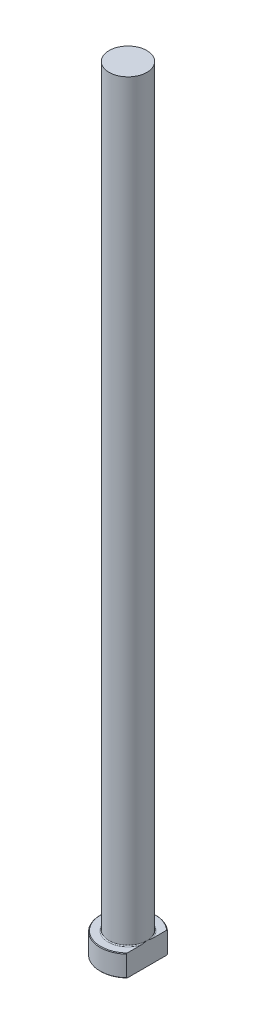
ISO-10303-21;
HEADER;
FILE_DESCRIPTION(('STEP AP214'),'2;1');
FILE_NAME('part.step','',(''),(''),'','','');
FILE_SCHEMA(('AUTOMOTIVE_DESIGN { 1 0 10303 214 1 1 1 1 }'));
ENDSEC;
DATA;
#1=APPLICATION_CONTEXT('core data for automotive mechanical design processes');
#2=APPLICATION_PROTOCOL_DEFINITION('international standard','automotive_design',2000,#1);
#3=PRODUCT_CONTEXT('',#1,'mechanical');
#4=PRODUCT('Part','Part','',(#3));
#5=PRODUCT_RELATED_PRODUCT_CATEGORY('part','',(#4));
#6=PRODUCT_DEFINITION_FORMATION('','',#4);
#7=PRODUCT_DEFINITION_CONTEXT('part definition',#1,'design');
#8=PRODUCT_DEFINITION('design','',#6,#7);
#9=PRODUCT_DEFINITION_SHAPE('','',#8);
#10=(LENGTH_UNIT() NAMED_UNIT(*) SI_UNIT(.MILLI.,.METRE.));
#11=(NAMED_UNIT(*) PLANE_ANGLE_UNIT() SI_UNIT($,.RADIAN.));
#12=(NAMED_UNIT(*) SI_UNIT($,.STERADIAN.) SOLID_ANGLE_UNIT());
#13=UNCERTAINTY_MEASURE_WITH_UNIT(LENGTH_MEASURE(1.E-05),#10,'distance_accuracy_value','');
#14=(GEOMETRIC_REPRESENTATION_CONTEXT(3) GLOBAL_UNCERTAINTY_ASSIGNED_CONTEXT((#13)) GLOBAL_UNIT_ASSIGNED_CONTEXT((#10,
#11,#12)) REPRESENTATION_CONTEXT('',''));
#15=CARTESIAN_POINT('',(0.,0.,0.));
#16=DIRECTION('',(0.,0.,1.));
#17=DIRECTION('',(1.,0.,0.));
#18=AXIS2_PLACEMENT_3D('',#15,#16,#17);
#19=CARTESIAN_POINT('',(0.,0.,0.));
#20=DIRECTION('',(0.,-1.,0.));
#21=DIRECTION('',(0.,0.,-1.));
#22=AXIS2_PLACEMENT_3D('',#19,#20,#21);
#23=PLANE('',#22);
#24=CARTESIAN_POINT('',(0.,0.,0.));
#25=DIRECTION('',(0.,-1.,0.));
#26=DIRECTION('',(0.,0.,-1.));
#27=AXIS2_PLACEMENT_3D('',#24,#25,#26);
#28=CIRCLE('',#27,8.79999999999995);
#29=CARTESIAN_POINT('',(6.09999999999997,0.,6.34271235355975));
#30=VERTEX_POINT('',#29);
#31=CARTESIAN_POINT('',(6.09999999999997,0.,-6.34271235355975));
#32=VERTEX_POINT('',#31);
#33=EDGE_CURVE('E98',#30,#32,#28,.T.);
#34=ORIENTED_EDGE('',*,*,#33,.T.);
#35=DIRECTION('',(0.,0.,1.));
#36=VECTOR('',#35,1.);
#37=CARTESIAN_POINT('',(6.09999999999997,0.,-6.61740130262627));
#38=LINE('',#37,#36);
#39=EDGE_CURVE('E83',#32,#30,#38,.T.);
#40=ORIENTED_EDGE('',*,*,#39,.T.);
#41=EDGE_LOOP('',(#34,#40));
#42=FACE_BOUND('',#41,.T.);
#43=ADVANCED_FACE('F32',(#42),#23,.T.);
#44=CARTESIAN_POINT('',(0.,259.958771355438,0.));
#45=DIRECTION('',(0.,1.,0.));
#46=DIRECTION('',(0.,0.,1.));
#47=AXIS2_PLACEMENT_3D('',#44,#45,#46);
#48=CYLINDRICAL_SURFACE('',#47,8.99999999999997);
#49=CARTESIAN_POINT('',(0.,6.79999999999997,0.));
#50=DIRECTION('',(0.,1.,0.));
#51=DIRECTION('',(0.,0.,1.));
#52=AXIS2_PLACEMENT_3D('',#49,#50,#51);
#53=CIRCLE('',#52,8.99999999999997);
#54=CARTESIAN_POINT('',(6.09999999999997,6.79999999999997,6.61740130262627));
#55=VERTEX_POINT('',#54);
#56=CARTESIAN_POINT('',(6.09999999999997,6.79999999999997,-6.61740130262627));
#57=VERTEX_POINT('',#56);
#58=EDGE_CURVE('E104',#55,#57,#53,.F.);
#59=ORIENTED_EDGE('',*,*,#58,.T.);
#60=DIRECTION('',(0.,-1.,0.));
#61=VECTOR('',#60,1.);
#62=CARTESIAN_POINT('',(6.09999999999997,250.,-6.61740130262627));
#63=LINE('',#62,#61);
#64=CARTESIAN_POINT('',(6.09999999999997,0.200000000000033,-6.61740130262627));
#65=VERTEX_POINT('',#64);
#66=EDGE_CURVE('E183',#57,#65,#63,.T.);
#67=ORIENTED_EDGE('',*,*,#66,.T.);
#68=CARTESIAN_POINT('',(0.,0.200000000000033,0.));
#69=DIRECTION('',(0.,-1.,0.));
#70=DIRECTION('',(0.,0.,-1.));
#71=AXIS2_PLACEMENT_3D('',#68,#69,#70);
#72=CIRCLE('',#71,8.99999999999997);
#73=CARTESIAN_POINT('',(6.09999999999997,0.200000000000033,6.61740130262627));
#74=VERTEX_POINT('',#73);
#75=EDGE_CURVE('E100',#65,#74,#72,.F.);
#76=ORIENTED_EDGE('',*,*,#75,.T.);
#77=DIRECTION('',(0.,-1.,0.));
#78=VECTOR('',#77,1.);
#79=CARTESIAN_POINT('',(6.09999999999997,250.,6.61740130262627));
#80=LINE('',#79,#78);
#81=EDGE_CURVE('E93',#55,#74,#80,.T.);
#82=ORIENTED_EDGE('',*,*,#81,.F.);
#83=EDGE_LOOP('',(#59,#67,#76,#82));
#84=FACE_BOUND('',#83,.T.);
#85=ADVANCED_FACE('F158',(#84),#48,.T.);
#86=CARTESIAN_POINT('',(-8.99999999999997,7.,0.));
#87=DIRECTION('',(0.,1.,0.));
#88=DIRECTION('',(0.,0.,1.));
#89=AXIS2_PLACEMENT_3D('',#86,#87,#88);
#90=PLANE('',#89);
#91=CARTESIAN_POINT('',(0.,7.,0.));
#92=DIRECTION('',(0.,1.,0.));
#93=DIRECTION('',(0.,0.,1.));
#94=AXIS2_PLACEMENT_3D('',#91,#92,#93);
#95=CIRCLE('',#94,8.79999999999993);
#96=CARTESIAN_POINT('',(6.09999999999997,7.,-6.34271235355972));
#97=VERTEX_POINT('',#96);
#98=CARTESIAN_POINT('',(6.09999999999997,7.,6.34271235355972));
#99=VERTEX_POINT('',#98);
#100=EDGE_CURVE('E178',#97,#99,#95,.T.);
#101=ORIENTED_EDGE('',*,*,#100,.T.);
#102=DIRECTION('',(0.,0.,-1.));
#103=VECTOR('',#102,1.);
#104=CARTESIAN_POINT('',(6.09999999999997,7.,0.));
#105=LINE('',#104,#103);
#106=CARTESIAN_POINT('',(6.09999999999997,6.99999999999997,1.9364916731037));
#107=VERTEX_POINT('',#106);
#108=EDGE_CURVE('E57',#99,#107,#105,.T.);
#109=ORIENTED_EDGE('',*,*,#108,.T.);
#110=CARTESIAN_POINT('',(0.,7.,0.));
#111=DIRECTION('',(0.,1.,0.));
#112=DIRECTION('',(0.,0.,1.));
#113=AXIS2_PLACEMENT_3D('',#110,#111,#112);
#114=CIRCLE('',#113,6.39999999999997);
#115=CARTESIAN_POINT('',(6.09999999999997,6.99999999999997,-1.9364916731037));
#116=VERTEX_POINT('',#115);
#117=EDGE_CURVE('E107',#107,#116,#114,.F.);
#118=ORIENTED_EDGE('',*,*,#117,.T.);
#119=EDGE_CURVE('E136',#116,#97,#105,.T.);
#120=ORIENTED_EDGE('',*,*,#119,.T.);
#121=EDGE_LOOP('',(#101,#109,#118,#120));
#122=FACE_BOUND('',#121,.T.);
#123=ADVANCED_FACE('F147',(#122),#90,.T.);
#124=CARTESIAN_POINT('',(0.,7.00000000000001,0.));
#125=DIRECTION('',(0.,-1.,0.));
#126=DIRECTION('',(0.,0.,-1.));
#127=AXIS2_PLACEMENT_3D('',#124,#125,#126);
#128=CONICAL_SURFACE('',#127,8.79999999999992,0.785398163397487);
#129=ORIENTED_EDGE('',*,*,#58,.F.);
#130=CARTESIAN_POINT('',(6.09999999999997,0.0143792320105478,14.5593895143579));
#131=CARTESIAN_POINT('',(6.09999999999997,0.214324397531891,14.3426005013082));
#132=CARTESIAN_POINT('',(6.09999999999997,0.41391350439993,14.1254831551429));
#133=CARTESIAN_POINT('',(6.09999999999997,0.812271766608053,13.6904946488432));
#134=CARTESIAN_POINT('',(6.09999999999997,1.01104091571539,13.4726234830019));
#135=CARTESIAN_POINT('',(6.09999999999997,1.60603894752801,12.8176429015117));
#136=CARTESIAN_POINT('',(6.09999999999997,2.00087078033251,12.3792612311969));
#137=CARTESIAN_POINT('',(6.09999999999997,2.78792222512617,11.4954287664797));
#138=CARTESIAN_POINT('',(6.09999999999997,3.1801120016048,11.0499513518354));
#139=CARTESIAN_POINT('',(6.09999999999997,3.95753447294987,10.1530375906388));
#140=CARTESIAN_POINT('',(6.09999999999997,4.34276798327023,9.70160195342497));
#141=CARTESIAN_POINT('',(6.09999999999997,5.03085646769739,8.87725822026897));
#142=CARTESIAN_POINT('',(6.09999999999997,5.3354184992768,8.50578180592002));
#143=CARTESIAN_POINT('',(6.09999999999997,5.78551221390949,7.94308202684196));
#144=CARTESIAN_POINT('',(6.09999999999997,5.93443884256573,7.75457459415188));
#145=CARTESIAN_POINT('',(6.09999999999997,6.22957503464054,7.37544710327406));
#146=CARTESIAN_POINT('',(6.09999999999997,6.37578465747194,7.18482709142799));
#147=CARTESIAN_POINT('',(6.09999999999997,6.66478900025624,6.80131984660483));
#148=CARTESIAN_POINT('',(6.09999999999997,6.80758709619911,6.60843516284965));
#149=CARTESIAN_POINT('',(6.09999999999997,7.08920912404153,6.21979246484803));
#150=CARTESIAN_POINT('',(6.09999999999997,7.22803324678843,6.02403458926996));
#151=CARTESIAN_POINT('',(6.09999999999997,7.5007456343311,5.62920968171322));
#152=CARTESIAN_POINT('',(6.09999999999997,7.6346357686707,5.43014394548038));
#153=CARTESIAN_POINT('',(6.09999999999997,7.89632379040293,5.02806147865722));
#154=CARTESIAN_POINT('',(6.09999999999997,8.02412236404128,4.82504519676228));
#155=CARTESIAN_POINT('',(6.09999999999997,8.27075787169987,4.41652900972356));
#156=CARTESIAN_POINT('',(6.09999999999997,8.38967506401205,4.2110778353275));
#157=CARTESIAN_POINT('',(6.09999999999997,8.61801299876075,3.79489291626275));
#158=CARTESIAN_POINT('',(6.09999999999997,8.72743269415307,3.58415859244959));
#159=CARTESIAN_POINT('',(6.09999999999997,8.93404173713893,3.15694629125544));
#160=CARTESIAN_POINT('',(6.09999999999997,9.03124152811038,2.94047341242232));
#161=CARTESIAN_POINT('',(6.09999999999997,9.21017577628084,2.50119284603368));
#162=CARTESIAN_POINT('',(6.09999999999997,9.29191471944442,2.27838701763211));
#163=CARTESIAN_POINT('',(6.09999999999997,9.42038701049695,1.87551854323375));
#164=CARTESIAN_POINT('',(6.09999999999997,9.47086768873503,1.69665770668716));
#165=CARTESIAN_POINT('',(6.09999999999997,9.5579598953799,1.33556522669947));
#166=CARTESIAN_POINT('',(6.09999999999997,9.59457323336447,1.15333402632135));
#167=CARTESIAN_POINT('',(6.09999999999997,9.65210004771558,0.786944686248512));
#168=CARTESIAN_POINT('',(6.09999999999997,9.67306111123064,0.602794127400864));
#169=CARTESIAN_POINT('',(6.09999999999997,9.69831980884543,0.233342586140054));
#170=CARTESIAN_POINT('',(6.09999999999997,9.70261818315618,0.0480416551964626));
#171=CARTESIAN_POINT('',(6.09999999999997,9.69429534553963,-0.322485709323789));
#172=CARTESIAN_POINT('',(6.09999999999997,9.68164564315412,-0.507711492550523));
#173=CARTESIAN_POINT('',(6.09999999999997,9.6400997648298,-0.876317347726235));
#174=CARTESIAN_POINT('',(6.09999999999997,9.61120224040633,-1.05969726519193));
#175=CARTESIAN_POINT('',(6.09999999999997,9.53854055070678,-1.42403078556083));
#176=CARTESIAN_POINT('',(6.09999999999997,9.49473105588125,-1.60497522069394));
#177=CARTESIAN_POINT('',(6.09999999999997,9.39417906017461,-1.9631904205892));
#178=CARTESIAN_POINT('',(6.09999999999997,9.33743624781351,-2.14046109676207));
#179=CARTESIAN_POINT('',(6.09999999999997,9.20325707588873,-2.51852539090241));
#180=CARTESIAN_POINT('',(6.09999999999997,9.12397188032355,-2.71865799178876));
#181=CARTESIAN_POINT('',(6.09999999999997,8.95352574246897,-3.11384323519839));
#182=CARTESIAN_POINT('',(6.09999999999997,8.86235948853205,-3.30889355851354));
#183=CARTESIAN_POINT('',(6.09999999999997,8.67035859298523,-3.69456420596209));
#184=CARTESIAN_POINT('',(6.09999999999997,8.56950736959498,-3.88517621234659));
#185=CARTESIAN_POINT('',(6.09999999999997,8.3601770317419,-4.26210307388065));
#186=CARTESIAN_POINT('',(6.09999999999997,8.25169895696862,-4.44841851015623));
#187=CARTESIAN_POINT('',(6.09999999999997,8.02723055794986,-4.81954803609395));
#188=CARTESIAN_POINT('',(6.09999999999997,7.91116499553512,-5.00431640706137));
#189=CARTESIAN_POINT('',(6.09999999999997,7.67391977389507,-5.3705334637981));
#190=CARTESIAN_POINT('',(6.09999999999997,7.55273998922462,-5.55198206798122));
#191=CARTESIAN_POINT('',(6.09999999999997,7.30632827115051,-5.91182164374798));
#192=CARTESIAN_POINT('',(6.09999999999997,7.18110067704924,-6.09021559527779));
#193=CARTESIAN_POINT('',(6.09999999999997,6.92719024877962,-6.44453156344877));
#194=CARTESIAN_POINT('',(6.09999999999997,6.79850727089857,-6.62045347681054));
#195=CARTESIAN_POINT('',(6.09999999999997,6.40743139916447,-7.14601004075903));
#196=CARTESIAN_POINT('',(6.09999999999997,6.14071269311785,-7.49242581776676));
#197=CARTESIAN_POINT('',(6.09999999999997,5.59909026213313,-8.17880344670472));
#198=CARTESIAN_POINT('',(6.09999999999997,5.32418574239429,-8.51876466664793));
#199=CARTESIAN_POINT('',(6.09999999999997,4.76812622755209,-9.19396082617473));
#200=CARTESIAN_POINT('',(6.09999999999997,4.48696661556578,-9.52919195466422));
#201=CARTESIAN_POINT('',(6.09999999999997,3.920067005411,-10.1957589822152));
#202=CARTESIAN_POINT('',(6.09999999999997,3.63432692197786,-10.5270948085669));
#203=CARTESIAN_POINT('',(6.09999999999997,3.07379660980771,-11.1700382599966));
#204=CARTESIAN_POINT('',(6.09999999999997,2.79918078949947,-11.4817981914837));
#205=CARTESIAN_POINT('',(6.09999999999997,2.24738477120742,-12.1030461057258));
#206=CARTESIAN_POINT('',(6.09999999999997,1.97020453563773,-12.4125340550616));
#207=CARTESIAN_POINT('',(6.09999999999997,1.41421579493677,-13.0291430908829));
#208=CARTESIAN_POINT('',(6.09999999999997,1.13541061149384,-13.3362671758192));
#209=CARTESIAN_POINT('',(6.09999999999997,0.576091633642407,-13.9489357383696));
#210=CARTESIAN_POINT('',(6.09999999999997,0.295577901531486,-14.2544802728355));
#211=CARTESIAN_POINT('',(6.09999999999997,0.0143792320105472,-14.5593895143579));
#212=B_SPLINE_CURVE_WITH_KNOTS('',3,(#130,#131,#132,#133,#134,#135,#136,#137,#138,#139,#140,
#141,#142,#143,#144,#145,#146,#147,#148,#149,#150,#151,#152,#153,#154,#155,#156,#157,#158,#159,
#160,#161,#162,#163,#164,#165,#166,#167,#168,#169,#170,#171,#172,#173,#174,#175,#176,#177,#178,
#179,#180,#181,#182,#183,#184,#185,#186,#187,#188,#189,#190,#191,#192,#193,#194,#195,#196,#197,
#198,#199,#200,#201,#202,#203,#204,#205,#206,#207,#208,#209,#210,#211),.UNSPECIFIED.,.F.,.F.,(4,
2,2,2,2,2,2,2,2,2,2,2,2,2,2,2,2,2,2,2,2,2,2,2,2,2,2,2,2,2,2,2,2,2,2,2,2,2,2,2,4),(0.,
0.884747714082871,1.76950214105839,3.53939834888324,5.31990146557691,7.10019448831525,
8.54118050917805,9.26187437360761,9.9825524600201,10.7024850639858,11.4223830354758,
12.1420053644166,12.8615464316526,13.5735035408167,14.2855390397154,14.9969618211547,
15.7081778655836,16.2652530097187,16.8222554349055,17.3775574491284,17.9328347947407,
18.4890467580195,19.0453048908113,19.6032692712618,20.1612470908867,20.806558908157,
21.4521602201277,22.0988872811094,22.7455263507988,23.4000191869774,24.0545280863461,
24.7083572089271,25.3622135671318,26.6736120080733,27.9851381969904,29.29766683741,
30.6102199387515,31.8565868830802,33.102972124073,34.3473597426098,35.5917022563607),.UNSPECIFIED.);
#213=EDGE_CURVE('E135',#55,#99,#212,.T.);
#214=ORIENTED_EDGE('',*,*,#213,.T.);
#215=ORIENTED_EDGE('',*,*,#100,.F.);
#216=EDGE_CURVE('E127',#97,#57,#212,.T.);
#217=ORIENTED_EDGE('',*,*,#216,.T.);
#218=EDGE_LOOP('',(#129,#214,#215,#217));
#219=FACE_BOUND('',#218,.T.);
#220=ADVANCED_FACE('F143',(#219),#128,.T.);
#221=CARTESIAN_POINT('',(0.,0.200000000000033,0.));
#222=DIRECTION('',(0.,1.,0.));
#223=DIRECTION('',(0.,0.,1.));
#224=AXIS2_PLACEMENT_3D('',#221,#222,#223);
#225=CONICAL_SURFACE('',#224,8.99999999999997,0.785398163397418);
#226=ORIENTED_EDGE('',*,*,#75,.F.);
#227=CARTESIAN_POINT('',(6.09999999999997,6.9856207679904,-14.5593895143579));
#228=CARTESIAN_POINT('',(6.09999999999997,6.78567560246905,-14.3426005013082));
#229=CARTESIAN_POINT('',(6.09999999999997,6.586086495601,-14.1254831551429));
#230=CARTESIAN_POINT('',(6.09999999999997,6.18772823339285,-13.6904946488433));
#231=CARTESIAN_POINT('',(6.09999999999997,5.98895908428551,-13.472623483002));
#232=CARTESIAN_POINT('',(6.09999999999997,5.39396105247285,-12.8176429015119));
#233=CARTESIAN_POINT('',(6.09999999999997,4.99912921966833,-12.3792612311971));
#234=CARTESIAN_POINT('',(6.09999999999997,4.21207777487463,-11.4954287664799));
#235=CARTESIAN_POINT('',(6.09999999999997,3.81988799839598,-11.0499513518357));
#236=CARTESIAN_POINT('',(6.09999999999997,3.04246552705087,-10.1530375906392));
#237=CARTESIAN_POINT('',(6.09999999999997,2.65723201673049,-9.70160195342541));
#238=CARTESIAN_POINT('',(6.09999999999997,1.96914353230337,-8.87725822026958));
#239=CARTESIAN_POINT('',(6.09999999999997,1.66458150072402,-8.50578180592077));
#240=CARTESIAN_POINT('',(6.09999999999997,1.21448778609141,-7.94308202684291));
#241=CARTESIAN_POINT('',(6.09999999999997,1.0655611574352,-7.7545745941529));
#242=CARTESIAN_POINT('',(6.09999999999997,0.77042496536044,-7.37544710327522));
#243=CARTESIAN_POINT('',(6.09999999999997,0.624215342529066,-7.18482709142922));
#244=CARTESIAN_POINT('',(6.09999999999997,0.335210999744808,-6.8013198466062));
#245=CARTESIAN_POINT('',(6.09999999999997,0.192412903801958,-6.6084351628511));
#246=CARTESIAN_POINT('',(6.09999999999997,-0.0892091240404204,-6.21979246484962));
#247=CARTESIAN_POINT('',(6.09999999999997,-0.228033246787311,-6.02403458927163));
#248=CARTESIAN_POINT('',(6.09999999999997,-0.500745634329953,-5.62920968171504));
#249=CARTESIAN_POINT('',(6.09999999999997,-0.634635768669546,-5.43014394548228));
#250=CARTESIAN_POINT('',(6.09999999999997,-0.896323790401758,-5.02806147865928));
#251=CARTESIAN_POINT('',(6.09999999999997,-1.02412236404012,-4.82504519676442));
#252=CARTESIAN_POINT('',(6.09999999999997,-1.27075787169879,-4.41652900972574));
#253=CARTESIAN_POINT('',(6.09999999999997,-1.38967506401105,-4.21107783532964));
#254=CARTESIAN_POINT('',(6.09999999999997,-1.61801299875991,-3.7948929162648));
#255=CARTESIAN_POINT('',(6.09999999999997,-1.72743269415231,-3.5841585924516));
#256=CARTESIAN_POINT('',(6.09999999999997,-1.93404173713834,-3.15694629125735));
#257=CARTESIAN_POINT('',(6.09999999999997,-2.03124152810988,-2.94047341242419));
#258=CARTESIAN_POINT('',(6.09999999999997,-2.21017577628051,-2.50119284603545));
#259=CARTESIAN_POINT('',(6.09999999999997,-2.29191471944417,-2.27838701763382));
#260=CARTESIAN_POINT('',(6.09999999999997,-2.42038701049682,-1.87551854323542));
#261=CARTESIAN_POINT('',(6.09999999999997,-2.47086768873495,-1.69665770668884));
#262=CARTESIAN_POINT('',(6.09999999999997,-2.55795989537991,-1.33556522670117));
#263=CARTESIAN_POINT('',(6.09999999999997,-2.59457323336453,-1.15333402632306));
#264=CARTESIAN_POINT('',(6.09999999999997,-2.65210004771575,-0.786944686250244));
#265=CARTESIAN_POINT('',(6.09999999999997,-2.67306111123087,-0.602794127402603));
#266=CARTESIAN_POINT('',(6.09999999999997,-2.69831980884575,-0.233342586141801));
#267=CARTESIAN_POINT('',(6.09999999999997,-2.70261818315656,-0.048041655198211));
#268=CARTESIAN_POINT('',(6.09999999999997,-2.69429534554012,0.322485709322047));
#269=CARTESIAN_POINT('',(6.09999999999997,-2.68164564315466,0.507711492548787));
#270=CARTESIAN_POINT('',(6.09999999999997,-2.64009976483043,0.876317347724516));
#271=CARTESIAN_POINT('',(6.09999999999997,-2.611202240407,1.05969726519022));
#272=CARTESIAN_POINT('',(6.09999999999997,-2.53854055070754,1.42403078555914));
#273=CARTESIAN_POINT('',(6.09999999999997,-2.49473105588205,1.60497522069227));
#274=CARTESIAN_POINT('',(6.09999999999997,-2.39417906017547,1.96319042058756));
#275=CARTESIAN_POINT('',(6.09999999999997,-2.3374362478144,2.14046109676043));
#276=CARTESIAN_POINT('',(6.09999999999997,-2.20325707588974,2.51852539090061));
#277=CARTESIAN_POINT('',(6.09999999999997,-2.12397188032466,2.7186579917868));
#278=CARTESIAN_POINT('',(6.09999999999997,-1.9535257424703,3.1138432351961));
#279=CARTESIAN_POINT('',(6.09999999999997,-1.8623594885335,3.30889355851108));
#280=CARTESIAN_POINT('',(6.09999999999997,-1.67035859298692,3.69456420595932));
#281=CARTESIAN_POINT('',(6.09999999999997,-1.56950736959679,3.88517621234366));
#282=CARTESIAN_POINT('',(6.09999999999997,-1.36017703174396,4.26210307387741));
#283=CARTESIAN_POINT('',(6.09999999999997,-1.25169895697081,4.44841851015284));
#284=CARTESIAN_POINT('',(6.09999999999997,-1.02723055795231,4.81954803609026));
#285=CARTESIAN_POINT('',(6.09999999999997,-0.9111649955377,5.00431640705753));
#286=CARTESIAN_POINT('',(6.09999999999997,-0.673919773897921,5.37053346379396));
#287=CARTESIAN_POINT('',(6.09999999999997,-0.552739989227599,5.55198206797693));
#288=CARTESIAN_POINT('',(6.09999999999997,-0.306328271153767,5.9118216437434));
#289=CARTESIAN_POINT('',(6.09999999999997,-0.18110067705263,6.09021559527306));
#290=CARTESIAN_POINT('',(6.09999999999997,0.0728097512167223,6.44453156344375));
#291=CARTESIAN_POINT('',(6.09999999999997,0.201492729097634,6.62045347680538));
#292=CARTESIAN_POINT('',(6.09999999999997,0.592568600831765,7.14601004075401));
#293=CARTESIAN_POINT('',(6.09999999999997,0.859287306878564,7.49242581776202));
#294=CARTESIAN_POINT('',(6.09999999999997,1.40090973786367,8.17880344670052));
#295=CARTESIAN_POINT('',(6.09999999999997,1.67581425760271,8.51876466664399));
#296=CARTESIAN_POINT('',(6.09999999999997,2.23187377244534,9.1939608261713));
#297=CARTESIAN_POINT('',(6.09999999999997,2.51303338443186,9.52919195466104));
#298=CARTESIAN_POINT('',(6.09999999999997,3.07993299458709,10.1957589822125));
#299=CARTESIAN_POINT('',(6.09999999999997,3.36567307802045,10.5270948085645));
#300=CARTESIAN_POINT('',(6.09999999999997,3.92620339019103,11.1700382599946));
#301=CARTESIAN_POINT('',(6.09999999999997,4.20081921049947,11.4817981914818));
#302=CARTESIAN_POINT('',(6.09999999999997,4.75261522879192,12.1030461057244));
#303=CARTESIAN_POINT('',(6.09999999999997,5.02979546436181,12.4125340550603));
#304=CARTESIAN_POINT('',(6.09999999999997,5.58578420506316,13.029143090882));
#305=CARTESIAN_POINT('',(6.09999999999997,5.86458938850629,13.3362671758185));
#306=CARTESIAN_POINT('',(6.09999999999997,6.42390836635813,13.9489357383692));
#307=CARTESIAN_POINT('',(6.09999999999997,6.70442209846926,14.2544802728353));
#308=CARTESIAN_POINT('',(6.09999999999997,6.9856207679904,14.5593895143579));
#309=B_SPLINE_CURVE_WITH_KNOTS('',3,(#227,#228,#229,#230,#231,#232,#233,#234,#235,#236,#237,
#238,#239,#240,#241,#242,#243,#244,#245,#246,#247,#248,#249,#250,#251,#252,#253,#254,#255,#256,
#257,#258,#259,#260,#261,#262,#263,#264,#265,#266,#267,#268,#269,#270,#271,#272,#273,#274,#275,
#276,#277,#278,#279,#280,#281,#282,#283,#284,#285,#286,#287,#288,#289,#290,#291,#292,#293,#294,
#295,#296,#297,#298,#299,#300,#301,#302,#303,#304,#305,#306,#307,#308),.UNSPECIFIED.,.F.,.F.,(4,
2,2,2,2,2,2,2,2,2,2,2,2,2,2,2,2,2,2,2,2,2,2,2,2,2,2,2,2,2,2,2,2,2,2,2,2,2,2,2,4),(0.,
0.884747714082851,1.76950214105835,3.53939834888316,5.31990146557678,7.10019448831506,
8.54118050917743,9.26187437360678,9.98255246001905,10.7024850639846,11.4223830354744,
12.1420053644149,12.8615464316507,13.573503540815,14.285539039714,14.9969618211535,
15.7081778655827,16.2652530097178,16.8222554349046,17.3775574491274,17.9328347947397,
18.4890467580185,19.0453048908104,19.6032692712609,20.1612470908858,20.8065589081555,
21.4521602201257,22.0988872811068,22.7455263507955,23.4000191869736,24.0545280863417,
24.708357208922,25.3622135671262,26.6736120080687,27.9851381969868,29.2976668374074,
30.6102199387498,31.8565868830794,33.102972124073,34.3473597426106,35.5917022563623),.UNSPECIFIED.);
#310=EDGE_CURVE('E86',#65,#32,#309,.T.);
#311=ORIENTED_EDGE('',*,*,#310,.T.);
#312=ORIENTED_EDGE('',*,*,#33,.F.);
#313=EDGE_CURVE('E89',#30,#74,#309,.T.);
#314=ORIENTED_EDGE('',*,*,#313,.T.);
#315=EDGE_LOOP('',(#226,#311,#312,#314));
#316=FACE_BOUND('',#315,.T.);
#317=ADVANCED_FACE('F97',(#316),#225,.T.);
#318=CARTESIAN_POINT('',(0.,7.29999999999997,0.));
#319=DIRECTION('',(0.,1.,0.));
#320=DIRECTION('',(0.,0.,1.));
#321=AXIS2_PLACEMENT_3D('',#318,#319,#320);
#322=TOROIDAL_SURFACE('',#321,6.39999999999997,0.3);
#323=CARTESIAN_POINT('',(6.09999999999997,7.29999999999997,0.));
#324=CARTESIAN_POINT('',(6.09999999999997,7.30000062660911,-8.49340882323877E-11));
#325=CARTESIAN_POINT('',(6.09999999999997,7.30000125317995,-2.89750604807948E-07));
#326=CARTESIAN_POINT('',(6.09999999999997,7.30000241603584,-1.06233729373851E-06));
#327=CARTESIAN_POINT('',(6.09999999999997,7.30000292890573,-1.56598288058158E-06));
#328=CARTESIAN_POINT('',(6.09999999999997,7.30000401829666,-2.78036834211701E-06));
#329=CARTESIAN_POINT('',(6.09999999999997,7.30000457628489,-3.51079357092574E-06));
#330=CARTESIAN_POINT('',(6.09999999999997,7.30000555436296,-5.00545869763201E-06));
#331=CARTESIAN_POINT('',(6.09999999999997,7.30000597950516,-5.76672403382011E-06));
#332=CARTESIAN_POINT('',(6.09999999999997,7.30000761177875,-8.78783125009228E-06));
#333=CARTESIAN_POINT('',(6.09999999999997,7.30000873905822,-1.10951031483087E-05));
#334=CARTESIAN_POINT('',(6.09999999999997,7.30001054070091,-1.56065756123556E-05));
#335=CARTESIAN_POINT('',(6.09999999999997,7.30001124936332,-1.77975625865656E-05));
#336=CARTESIAN_POINT('',(6.09999999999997,7.3000143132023,-2.72682416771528E-05));
#337=CARTESIAN_POINT('',(6.09999999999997,7.30001667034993,-3.45497120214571E-05));
#338=CARTESIAN_POINT('',(6.09999999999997,7.30002005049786,-4.8163199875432E-05));
#339=CARTESIAN_POINT('',(6.09999999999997,7.30002122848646,-5.44561398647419E-05));
#340=CARTESIAN_POINT('',(6.09999999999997,7.30002994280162,-0.000101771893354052));
#341=CARTESIAN_POINT('',(6.09999999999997,7.30003670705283,-0.000142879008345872));
#342=CARTESIAN_POINT('',(6.09999999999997,7.30006629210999,-0.000306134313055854));
#343=CARTESIAN_POINT('',(6.09999999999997,7.30009435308,-0.000427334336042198));
#344=CARTESIAN_POINT('',(6.09999999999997,7.30020422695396,-0.000909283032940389));
#345=CARTESIAN_POINT('',(6.09999999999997,7.30028277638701,-0.00127051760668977));
#346=CARTESIAN_POINT('',(6.09999999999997,7.30059854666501,-0.00271271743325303));
#347=CARTESIAN_POINT('',(6.09999999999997,7.30083994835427,-0.00379303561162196));
#348=CARTESIAN_POINT('',(6.09999999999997,7.30185162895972,-0.00833170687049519));
#349=CARTESIAN_POINT('',(6.09999999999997,7.30261657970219,-0.0117908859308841));
#350=CARTESIAN_POINT('',(6.09999999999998,7.30941584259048,-0.0425231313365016));
#351=CARTESIAN_POINT('',(6.09999999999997,7.31547175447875,-0.0697929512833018));
#352=CARTESIAN_POINT('',(6.09999999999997,7.32730575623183,-0.123231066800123));
#353=CARTESIAN_POINT('',(6.09999999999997,7.33308513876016,-0.149399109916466));
#354=CARTESIAN_POINT('',(6.09999999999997,7.34535810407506,-0.205120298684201));
#355=CARTESIAN_POINT('',(6.09999999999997,7.35184757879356,-0.234674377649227));
#356=CARTESIAN_POINT('',(6.09999999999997,7.36483397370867,-0.294125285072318));
#357=CARTESIAN_POINT('',(6.09999999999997,7.37133017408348,-0.324022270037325));
#358=CARTESIAN_POINT('',(6.09999999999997,7.3868079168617,-0.39575720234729));
#359=CARTESIAN_POINT('',(6.09999999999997,7.39574786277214,-0.437604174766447));
#360=CARTESIAN_POINT('',(6.09999999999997,7.41315372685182,-0.520210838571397));
#361=CARTESIAN_POINT('',(6.09999999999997,7.42162592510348,-0.560969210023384));
#362=CARTESIAN_POINT('',(6.09999999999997,7.44897438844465,-0.694856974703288));
#363=CARTESIAN_POINT('',(6.09999999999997,7.46725806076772,-0.788109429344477));
#364=CARTESIAN_POINT('',(6.09999999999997,7.50173201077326,-0.975940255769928));
#365=CARTESIAN_POINT('',(6.09999999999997,7.51790033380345,-1.07052272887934));
#366=CARTESIAN_POINT('',(6.09999999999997,7.5483609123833,-1.26941791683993));
#367=CARTESIAN_POINT('',(6.09999999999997,7.56231819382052,-1.37378304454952));
#368=CARTESIAN_POINT('',(6.09999999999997,7.58455179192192,-1.58284720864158));
#369=CARTESIAN_POINT('',(6.09999999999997,7.59284552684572,-1.68754421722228));
#370=CARTESIAN_POINT('',(6.09999999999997,7.59905685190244,-1.84322200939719));
#371=CARTESIAN_POINT('',(6.09999999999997,7.60011923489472,-1.89407517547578));
#372=CARTESIAN_POINT('',(6.09999999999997,7.59985882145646,-1.99583446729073));
#373=CARTESIAN_POINT('',(6.09999999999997,7.59853367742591,-2.04674059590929));
#374=CARTESIAN_POINT('',(6.09999999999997,7.59293461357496,-2.14745109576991));
#375=CARTESIAN_POINT('',(6.09999999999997,7.58871621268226,-2.19725829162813));
#376=CARTESIAN_POINT('',(6.09999999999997,7.57652343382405,-2.29636696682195));
#377=CARTESIAN_POINT('',(6.09999999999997,7.56855424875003,-2.34566904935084));
#378=CARTESIAN_POINT('',(6.09999999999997,7.54906685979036,-2.43557410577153));
#379=CARTESIAN_POINT('',(6.09999999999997,7.53830158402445,-2.47632837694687));
#380=CARTESIAN_POINT('',(6.09999999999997,7.51813116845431,-2.53619759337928));
#381=CARTESIAN_POINT('',(6.09999999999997,7.51071988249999,-2.55597892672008));
#382=CARTESIAN_POINT('',(6.09999999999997,7.49420581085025,-2.59481280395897));
#383=CARTESIAN_POINT('',(6.09999999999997,7.48510530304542,-2.61386628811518));
#384=CARTESIAN_POINT('',(6.09999999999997,7.46462437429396,-2.65097502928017));
#385=CARTESIAN_POINT('',(6.09999999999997,7.4532219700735,-2.66901833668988));
#386=CARTESIAN_POINT('',(6.09999999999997,7.42747894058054,-2.70281743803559));
#387=CARTESIAN_POINT('',(6.09999999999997,7.41316603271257,-2.71859257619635));
#388=CARTESIAN_POINT('',(6.09999999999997,7.39059237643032,-2.73744251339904));
#389=CARTESIAN_POINT('',(6.09999999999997,7.38392912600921,-2.74241546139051));
#390=CARTESIAN_POINT('',(6.09999999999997,7.36998483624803,-2.75142973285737));
#391=CARTESIAN_POINT('',(6.09999999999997,7.36270362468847,-2.75547079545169));
#392=CARTESIAN_POINT('',(6.09999999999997,7.34749053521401,-2.76237207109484));
#393=CARTESIAN_POINT('',(6.09999999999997,7.33955232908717,-2.76521867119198));
#394=CARTESIAN_POINT('',(6.09999999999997,7.3232826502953,-2.76936266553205));
#395=CARTESIAN_POINT('',(6.09999999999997,7.3149518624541,-2.7706626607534));
#396=CARTESIAN_POINT('',(6.09999999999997,7.29896440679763,-2.77151083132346));
#397=CARTESIAN_POINT('',(6.09999999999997,7.29131555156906,-2.77120796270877));
#398=CARTESIAN_POINT('',(6.09999999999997,7.27619804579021,-2.76922646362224));
#399=CARTESIAN_POINT('',(6.09999999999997,7.26872952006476,-2.76754690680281));
#400=CARTESIAN_POINT('',(6.09999999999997,7.25296547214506,-2.76260061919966));
#401=CARTESIAN_POINT('',(6.09999999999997,7.24473928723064,-2.75911619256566));
#402=CARTESIAN_POINT('',(6.09999999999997,7.22896148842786,-2.75086515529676));
#403=CARTESIAN_POINT('',(6.09999999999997,7.22141106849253,-2.74609633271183));
#404=CARTESIAN_POINT('',(6.09999999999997,7.20301227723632,-2.73270182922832));
#405=CARTESIAN_POINT('',(6.09999999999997,7.1926580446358,-2.72340416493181));
#406=CARTESIAN_POINT('',(6.09999999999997,7.1734395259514,-2.70338710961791));
#407=CARTESIAN_POINT('',(6.09999999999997,7.1645795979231,-2.69266371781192));
#408=CARTESIAN_POINT('',(6.09999999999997,7.14025540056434,-2.65971164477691));
#409=CARTESIAN_POINT('',(6.09999999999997,7.12651072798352,-2.63622875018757));
#410=CARTESIAN_POINT('',(6.09999999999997,7.10227969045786,-2.58772082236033));
#411=CARTESIAN_POINT('',(6.09999999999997,7.09179747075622,-2.56269387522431));
#412=CARTESIAN_POINT('',(6.09999999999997,7.0688846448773,-2.49991766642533));
#413=CARTESIAN_POINT('',(6.09999999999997,7.05782215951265,-2.46167427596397));
#414=CARTESIAN_POINT('',(6.09999999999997,7.03925041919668,-2.38430824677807));
#415=CARTESIAN_POINT('',(6.09999999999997,7.03174899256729,-2.34518386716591));
#416=CARTESIAN_POINT('',(6.09999999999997,7.01934937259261,-2.26583226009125));
#417=CARTESIAN_POINT('',(6.09999999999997,7.01449904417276,-2.22559771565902));
#418=CARTESIAN_POINT('',(6.09999999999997,7.00701943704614,-2.14499086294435));
#419=CARTESIAN_POINT('',(6.09999999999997,7.00438710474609,-2.10461882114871));
#420=CARTESIAN_POINT('',(6.09999999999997,6.99952969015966,-1.99154987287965));
#421=CARTESIAN_POINT('',(6.09999999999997,6.99930606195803,-1.91876811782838));
#422=CARTESIAN_POINT('',(6.09999999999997,7.00309053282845,-1.77330138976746));
#423=CARTESIAN_POINT('',(6.09999999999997,7.00710151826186,-1.70061651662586));
#424=CARTESIAN_POINT('',(6.09999999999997,7.01839350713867,-1.55515240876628));
#425=CARTESIAN_POINT('',(6.09999999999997,7.02569039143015,-1.4823744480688));
#426=CARTESIAN_POINT('',(6.09999999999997,7.0428282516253,-1.33711517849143));
#427=CARTESIAN_POINT('',(6.09999999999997,7.05266964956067,-1.2646339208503));
#428=CARTESIAN_POINT('',(6.09999999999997,7.08305970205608,-1.06158751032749));
#429=CARTESIAN_POINT('',(6.09999999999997,7.1058392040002,-0.931360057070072));
#430=CARTESIAN_POINT('',(6.09999999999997,7.15498382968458,-0.6732160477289));
#431=CARTESIAN_POINT('',(6.09999999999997,7.18130321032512,-0.545290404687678));
#432=CARTESIAN_POINT('',(6.09999999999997,7.2144838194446,-0.38980494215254));
#433=CARTESIAN_POINT('',(6.09999999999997,7.22045276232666,-0.362051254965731));
#434=CARTESIAN_POINT('',(6.09999999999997,7.23263801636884,-0.305748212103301));
#435=CARTESIAN_POINT('',(6.09999999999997,7.2388564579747,-0.277199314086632));
#436=CARTESIAN_POINT('',(6.09999999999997,7.25406223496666,-0.207696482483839));
#437=CARTESIAN_POINT('',(6.09999999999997,7.26307730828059,-0.166748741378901));
#438=CARTESIAN_POINT('',(6.09999999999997,7.28028241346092,-0.0889531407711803));
#439=CARTESIAN_POINT('',(6.09999999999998,7.28846503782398,-0.052103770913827));
#440=CARTESIAN_POINT('',(6.09999999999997,7.29738224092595,-0.0117959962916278));
#441=CARTESIAN_POINT('',(6.09999999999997,7.2981461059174,-0.00834194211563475));
#442=CARTESIAN_POINT('',(6.09999999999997,7.29915753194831,-0.0038044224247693));
#443=CARTESIAN_POINT('',(6.09999999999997,7.29939981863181,-0.00272013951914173));
#444=CARTESIAN_POINT('',(6.09999999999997,7.29971666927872,-0.00127300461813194));
#445=CARTESIAN_POINT('',(6.09999999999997,7.29979542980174,-0.000910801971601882));
#446=CARTESIAN_POINT('',(6.09999999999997,7.29990555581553,-0.000427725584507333));
#447=CARTESIAN_POINT('',(6.09999999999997,7.29993365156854,-0.000306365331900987));
#448=CARTESIAN_POINT('',(6.09999999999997,7.29996326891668,-0.000142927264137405));
#449=CARTESIAN_POINT('',(6.09999999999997,7.29997003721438,-0.000101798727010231));
#450=CARTESIAN_POINT('',(6.09999999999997,7.29997875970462,-5.44609821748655E-05));
#451=CARTESIAN_POINT('',(6.09999999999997,7.29997993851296,-4.81669455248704E-05));
#452=CARTESIAN_POINT('',(6.09999999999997,7.29998332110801,-3.45511307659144E-05));
#453=CARTESIAN_POINT('',(6.09999999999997,7.29998568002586,-2.726848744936E-05));
#454=CARTESIAN_POINT('',(6.09999999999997,7.2999887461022,-1.77965710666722E-05));
#455=CARTESIAN_POINT('',(6.09999999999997,7.29998945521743,-1.5605504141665E-05));
#456=CARTESIAN_POINT('',(6.09999999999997,7.29999125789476,-1.10939383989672E-05));
#457=CARTESIAN_POINT('',(6.09999999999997,7.29999238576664,-8.78666464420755E-06));
#458=CARTESIAN_POINT('',(6.09999999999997,7.29999401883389,-5.76563104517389E-06));
#459=CARTESIAN_POINT('',(6.09999999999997,7.2999944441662,-5.00441018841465E-06));
#460=CARTESIAN_POINT('',(6.09999999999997,7.29999542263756,-3.50986831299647E-06));
#461=CARTESIAN_POINT('',(6.09999999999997,7.29999598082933,-2.77952359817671E-06));
#462=CARTESIAN_POINT('',(6.09999999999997,7.29999707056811,-1.56532290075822E-06));
#463=CARTESIAN_POINT('',(6.09999999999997,7.29999758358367,-1.06177376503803E-06));
#464=CARTESIAN_POINT('',(6.09999999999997,7.29999874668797,-2.89436475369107E-07));
#465=CARTESIAN_POINT('',(6.09999999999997,7.29999937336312,8.49378445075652E-11));
#466=CARTESIAN_POINT('',(6.09999999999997,7.29999999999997,0.));
#467=B_SPLINE_CURVE_WITH_KNOTS('',3,(#323,#324,#325,#326,#327,#328,#329,#330,#331,#332,#333,
#334,#335,#336,#337,#338,#339,#340,#341,#342,#343,#344,#345,#346,#347,#348,#349,#350,#351,#352,
#353,#354,#355,#356,#357,#358,#359,#360,#361,#362,#363,#364,#365,#366,#367,#368,#369,#370,#371,
#372,#373,#374,#375,#376,#377,#378,#379,#380,#381,#382,#383,#384,#385,#386,#387,#388,#389,#390,
#391,#392,#393,#394,#395,#396,#397,#398,#399,#400,#401,#402,#403,#404,#405,#406,#407,#408,#409,
#410,#411,#412,#413,#414,#415,#416,#417,#418,#419,#420,#421,#422,#423,#424,#425,#426,#427,#428,
#429,#430,#431,#432,#433,#434,#435,#436,#437,#438,#439,#440,#441,#442,#443,#444,#445,#446,#447,
#448,#449,#450,#451,#452,#453,#454,#455,#456,#457,#458,#459,#460,#461,#462,#463,#464,#465,#466),
.UNSPECIFIED.,.T.,.F.,(4,2,2,2,2,2,2,2,2,2,2,2,2,2,2,2,2,2,2,2,2,2,2,2,2,2,2,2,2,2,2,2,2,2,2,2,
2,2,2,2,2,2,2,2,2,2,2,2,2,2,2,2,2,2,2,2,2,2,2,2,2,2,2,2,2,2,2,2,2,2,2,4),(0.,
1.91250960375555E-06,4.08178522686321E-06,6.8194531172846E-06,9.4346481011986E-06,
1.71137963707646E-05,2.40155063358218E-05,4.6944459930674E-05,6.61299340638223E-05,
0.000191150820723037,0.00056409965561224,0.00167341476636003,0.00499394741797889,
0.015622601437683,0.0994231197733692,0.179819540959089,0.270593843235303,0.362377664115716,
0.49075076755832,0.6156392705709,0.900704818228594,1.18852716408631,1.50431807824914,
1.81913334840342,1.97168386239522,2.12438445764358,2.27423396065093,2.4238766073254,
2.55004267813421,2.61335958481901,2.67659172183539,2.74045901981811,2.80374440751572,
2.82862908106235,2.85352071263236,2.87868879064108,2.90381448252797,2.92664866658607,
2.94949822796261,2.97615207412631,3.00285211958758,3.04436429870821,3.0859955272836,
3.16716680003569,3.24844079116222,3.36758630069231,3.48699253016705,3.60848882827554,
3.72981758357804,3.94797165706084,4.16627452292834,4.38564396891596,4.60504982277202,
5.00154620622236,5.3933388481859,5.47850384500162,5.56615847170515,5.69194439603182,
5.80518254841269,5.81579547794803,5.81912819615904,5.82024048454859,5.82061392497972,
5.82073901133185,5.82075820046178,5.82078113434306,5.82078803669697,5.82079571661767,
5.82079833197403,5.820801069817,5.82080323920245,5.82080515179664),.UNSPECIFIED.);
#468=CARTESIAN_POINT('',(6.09999999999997,7.29999999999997,0.));
#469=VERTEX_POINT('',#468);
#470=EDGE_CURVE('E11',#116,#469,#467,.T.);
#471=ORIENTED_EDGE('',*,*,#470,.F.);
#472=ORIENTED_EDGE('',*,*,#117,.F.);
#473=CARTESIAN_POINT('',(6.09999999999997,7.29999999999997,0.));
#474=CARTESIAN_POINT('',(6.09999999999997,7.29999937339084,8.49339302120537E-11));
#475=CARTESIAN_POINT('',(6.09999999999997,7.29999874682,2.89750604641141E-07));
#476=CARTESIAN_POINT('',(6.09999999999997,7.29999758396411,1.06233729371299E-06));
#477=CARTESIAN_POINT('',(6.09999999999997,7.29999707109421,1.56598288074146E-06));
#478=CARTESIAN_POINT('',(6.09999999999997,7.29999598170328,2.78036834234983E-06));
#479=CARTESIAN_POINT('',(6.09999999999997,7.29999542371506,3.51079357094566E-06));
#480=CARTESIAN_POINT('',(6.09999999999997,7.29999444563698,5.00545869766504E-06));
#481=CARTESIAN_POINT('',(6.09999999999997,7.29999402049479,5.76672403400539E-06));
#482=CARTESIAN_POINT('',(6.09999999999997,7.2999923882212,8.78783125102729E-06));
#483=CARTESIAN_POINT('',(6.09999999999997,7.29999126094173,1.10951031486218E-05));
#484=CARTESIAN_POINT('',(6.09999999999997,7.29998945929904,1.56065756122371E-05));
#485=CARTESIAN_POINT('',(6.09999999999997,7.29998875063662,1.77975625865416E-05));
#486=CARTESIAN_POINT('',(6.09999999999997,7.29998568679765,2.72682416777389E-05));
#487=CARTESIAN_POINT('',(6.09999999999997,7.29998332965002,3.45497120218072E-05));
#488=CARTESIAN_POINT('',(6.09999999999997,7.29997994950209,4.81631998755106E-05));
#489=CARTESIAN_POINT('',(6.09999999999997,7.29997877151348,5.44561398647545E-05));
#490=CARTESIAN_POINT('',(6.09999999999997,7.29997005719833,0.000101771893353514));
#491=CARTESIAN_POINT('',(6.09999999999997,7.29996329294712,0.000142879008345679));
#492=CARTESIAN_POINT('',(6.09999999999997,7.29993370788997,0.000306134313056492));
#493=CARTESIAN_POINT('',(6.09999999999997,7.29990564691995,0.000427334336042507));
#494=CARTESIAN_POINT('',(6.09999999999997,7.29979577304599,0.000909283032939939));
#495=CARTESIAN_POINT('',(6.09999999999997,7.29971722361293,0.00127051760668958));
#496=CARTESIAN_POINT('',(6.09999999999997,7.29940145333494,0.00271271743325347));
#497=CARTESIAN_POINT('',(6.09999999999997,7.29916005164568,0.00379303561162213));
#498=CARTESIAN_POINT('',(6.09999999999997,7.29814837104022,0.00833170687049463));
#499=CARTESIAN_POINT('',(6.09999999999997,7.29738342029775,0.0117908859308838));
#500=CARTESIAN_POINT('',(6.09999999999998,7.29058415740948,0.0425231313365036));
#501=CARTESIAN_POINT('',(6.09999999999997,7.2845282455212,0.0697929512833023));
#502=CARTESIAN_POINT('',(6.09999999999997,7.27269424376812,0.123231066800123));
#503=CARTESIAN_POINT('',(6.09999999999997,7.26691486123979,0.149399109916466));
#504=CARTESIAN_POINT('',(6.09999999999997,7.25464189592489,0.205120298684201));
#505=CARTESIAN_POINT('',(6.09999999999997,7.24815242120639,0.234674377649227));
#506=CARTESIAN_POINT('',(6.09999999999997,7.23516602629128,0.294125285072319));
#507=CARTESIAN_POINT('',(6.09999999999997,7.22866982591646,0.324022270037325));
#508=CARTESIAN_POINT('',(6.09999999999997,7.21319208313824,0.39575720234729));
#509=CARTESIAN_POINT('',(6.09999999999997,7.2042521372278,0.437604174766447));
#510=CARTESIAN_POINT('',(6.09999999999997,7.18684627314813,0.520210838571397));
#511=CARTESIAN_POINT('',(6.09999999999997,7.17837407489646,0.560969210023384));
#512=CARTESIAN_POINT('',(6.09999999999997,7.1510256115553,0.694856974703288));
#513=CARTESIAN_POINT('',(6.09999999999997,7.13274193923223,0.788109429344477));
#514=CARTESIAN_POINT('',(6.09999999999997,7.09826798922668,0.975940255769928));
#515=CARTESIAN_POINT('',(6.09999999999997,7.0820996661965,1.07052272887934));
#516=CARTESIAN_POINT('',(6.09999999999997,7.05163908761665,1.26941791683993));
#517=CARTESIAN_POINT('',(6.09999999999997,7.03768180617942,1.37378304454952));
#518=CARTESIAN_POINT('',(6.09999999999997,7.01544820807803,1.58284720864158));
#519=CARTESIAN_POINT('',(6.09999999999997,7.00715447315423,1.68754421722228));
#520=CARTESIAN_POINT('',(6.09999999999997,7.0009431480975,1.84322200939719));
#521=CARTESIAN_POINT('',(6.09999999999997,6.99988076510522,1.89407517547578));
#522=CARTESIAN_POINT('',(6.09999999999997,7.00014117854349,1.99583446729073));
#523=CARTESIAN_POINT('',(6.09999999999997,7.00146632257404,2.04674059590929));
#524=CARTESIAN_POINT('',(6.09999999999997,7.00706538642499,2.14745109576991));
#525=CARTESIAN_POINT('',(6.09999999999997,7.01128378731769,2.19725829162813));
#526=CARTESIAN_POINT('',(6.09999999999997,7.0234765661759,2.29636696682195));
#527=CARTESIAN_POINT('',(6.09999999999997,7.03144575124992,2.34566904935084));
#528=CARTESIAN_POINT('',(6.09999999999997,7.05093314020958,2.43557410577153));
#529=CARTESIAN_POINT('',(6.09999999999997,7.06169841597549,2.47632837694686));
#530=CARTESIAN_POINT('',(6.09999999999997,7.08186883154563,2.53619759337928));
#531=CARTESIAN_POINT('',(6.09999999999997,7.08928011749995,2.55597892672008));
#532=CARTESIAN_POINT('',(6.09999999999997,7.1057941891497,2.59481280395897));
#533=CARTESIAN_POINT('',(6.09999999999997,7.11489469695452,2.61386628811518));
#534=CARTESIAN_POINT('',(6.09999999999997,7.13537562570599,2.65097502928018));
#535=CARTESIAN_POINT('',(6.09999999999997,7.14677802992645,2.66901833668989));
#536=CARTESIAN_POINT('',(6.09999999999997,7.17252105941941,2.70281743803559));
#537=CARTESIAN_POINT('',(6.09999999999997,7.18683396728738,2.71859257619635));
#538=CARTESIAN_POINT('',(6.09999999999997,7.20940762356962,2.73744251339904));
#539=CARTESIAN_POINT('',(6.09999999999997,7.21607087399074,2.74241546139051));
#540=CARTESIAN_POINT('',(6.09999999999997,7.23001516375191,2.75142973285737));
#541=CARTESIAN_POINT('',(6.09999999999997,7.23729637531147,2.75547079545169));
#542=CARTESIAN_POINT('',(6.09999999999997,7.25250946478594,2.76237207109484));
#543=CARTESIAN_POINT('',(6.09999999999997,7.26044767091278,2.76521867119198));
#544=CARTESIAN_POINT('',(6.09999999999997,7.27671734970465,2.76936266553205));
#545=CARTESIAN_POINT('',(6.09999999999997,7.28504813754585,2.7706626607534));
#546=CARTESIAN_POINT('',(6.09999999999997,7.30103559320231,2.77151083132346));
#547=CARTESIAN_POINT('',(6.09999999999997,7.30868444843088,2.77120796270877));
#548=CARTESIAN_POINT('',(6.09999999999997,7.32380195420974,2.76922646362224));
#549=CARTESIAN_POINT('',(6.09999999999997,7.33127047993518,2.76754690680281));
#550=CARTESIAN_POINT('',(6.09999999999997,7.34703452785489,2.76260061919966));
#551=CARTESIAN_POINT('',(6.09999999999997,7.35526071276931,2.75911619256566));
#552=CARTESIAN_POINT('',(6.09999999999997,7.37103851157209,2.75086515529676));
#553=CARTESIAN_POINT('',(6.09999999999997,7.37858893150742,2.74609633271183));
#554=CARTESIAN_POINT('',(6.09999999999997,7.39698772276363,2.73270182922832));
#555=CARTESIAN_POINT('',(6.09999999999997,7.40734195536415,2.72340416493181));
#556=CARTESIAN_POINT('',(6.09999999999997,7.42656047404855,2.70338710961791));
#557=CARTESIAN_POINT('',(6.09999999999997,7.43542040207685,2.69266371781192));
#558=CARTESIAN_POINT('',(6.09999999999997,7.45974459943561,2.65971164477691));
#559=CARTESIAN_POINT('',(6.09999999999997,7.47348927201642,2.63622875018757));
#560=CARTESIAN_POINT('',(6.09999999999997,7.49772030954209,2.58772082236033));
#561=CARTESIAN_POINT('',(6.09999999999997,7.50820252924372,2.56269387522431));
#562=CARTESIAN_POINT('',(6.09999999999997,7.53111535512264,2.49991766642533));
#563=CARTESIAN_POINT('',(6.09999999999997,7.54217784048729,2.46167427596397));
#564=CARTESIAN_POINT('',(6.09999999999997,7.56074958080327,2.38430824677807));
#565=CARTESIAN_POINT('',(6.09999999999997,7.56825100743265,2.34518386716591));
#566=CARTESIAN_POINT('',(6.09999999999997,7.58065062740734,2.26583226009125));
#567=CARTESIAN_POINT('',(6.09999999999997,7.58550095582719,2.22559771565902));
#568=CARTESIAN_POINT('',(6.09999999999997,7.59298056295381,2.14499086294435));
#569=CARTESIAN_POINT('',(6.09999999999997,7.59561289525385,2.10461882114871));
#570=CARTESIAN_POINT('',(6.09999999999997,7.60047030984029,1.99154987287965));
#571=CARTESIAN_POINT('',(6.09999999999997,7.60069393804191,1.91876811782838));
#572=CARTESIAN_POINT('',(6.09999999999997,7.59690946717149,1.77330138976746));
#573=CARTESIAN_POINT('',(6.09999999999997,7.59289848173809,1.70061651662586));
#574=CARTESIAN_POINT('',(6.09999999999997,7.58160649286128,1.55515240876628));
#575=CARTESIAN_POINT('',(6.09999999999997,7.5743096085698,1.4823744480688));
#576=CARTESIAN_POINT('',(6.09999999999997,7.55717174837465,1.33711517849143));
#577=CARTESIAN_POINT('',(6.09999999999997,7.54733035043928,1.2646339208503));
#578=CARTESIAN_POINT('',(6.09999999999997,7.51694029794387,1.06158751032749));
#579=CARTESIAN_POINT('',(6.09999999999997,7.49416079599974,0.931360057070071));
#580=CARTESIAN_POINT('',(6.09999999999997,7.44501617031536,0.673216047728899));
#581=CARTESIAN_POINT('',(6.09999999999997,7.41869678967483,0.545290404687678));
#582=CARTESIAN_POINT('',(6.09999999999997,7.38551618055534,0.38980494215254));
#583=CARTESIAN_POINT('',(6.09999999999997,7.37954723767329,0.362051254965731));
#584=CARTESIAN_POINT('',(6.09999999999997,7.36736198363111,0.305748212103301));
#585=CARTESIAN_POINT('',(6.09999999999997,7.36114354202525,0.277199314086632));
#586=CARTESIAN_POINT('',(6.09999999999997,7.34593776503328,0.20769648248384));
#587=CARTESIAN_POINT('',(6.09999999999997,7.33692269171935,0.166748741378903));
#588=CARTESIAN_POINT('',(6.09999999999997,7.31971758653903,0.0889531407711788));
#589=CARTESIAN_POINT('',(6.09999999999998,7.31153496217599,0.0521037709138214));
#590=CARTESIAN_POINT('',(6.09999999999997,7.302617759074,0.0117959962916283));
#591=CARTESIAN_POINT('',(6.09999999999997,7.30185389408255,0.00834194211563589));
#592=CARTESIAN_POINT('',(6.09999999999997,7.30084246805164,0.00380442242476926));
#593=CARTESIAN_POINT('',(6.09999999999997,7.30060018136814,0.00272013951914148));
#594=CARTESIAN_POINT('',(6.09999999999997,7.30028333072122,0.00127300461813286));
#595=CARTESIAN_POINT('',(6.09999999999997,7.30020457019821,0.000910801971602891));
#596=CARTESIAN_POINT('',(6.09999999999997,7.30009444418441,0.000427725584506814));
#597=CARTESIAN_POINT('',(6.09999999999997,7.30006634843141,0.000306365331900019));
#598=CARTESIAN_POINT('',(6.09999999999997,7.30003673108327,0.000142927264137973));
#599=CARTESIAN_POINT('',(6.09999999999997,7.30002996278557,0.000101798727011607));
#600=CARTESIAN_POINT('',(6.09999999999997,7.30002124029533,5.44609821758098E-05));
#601=CARTESIAN_POINT('',(6.09999999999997,7.30002006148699,4.81669455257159E-05));
#602=CARTESIAN_POINT('',(6.09999999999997,7.30001667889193,3.45511307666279E-05));
#603=CARTESIAN_POINT('',(6.09999999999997,7.30001431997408,2.72684874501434E-05));
#604=CARTESIAN_POINT('',(6.09999999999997,7.30001125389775,1.77965710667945E-05));
#605=CARTESIAN_POINT('',(6.09999999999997,7.30001054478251,1.5605504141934E-05));
#606=CARTESIAN_POINT('',(6.09999999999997,7.30000874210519,1.10939383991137E-05));
#607=CARTESIAN_POINT('',(6.09999999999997,7.30000761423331,8.78666464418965E-06));
#608=CARTESIAN_POINT('',(6.09999999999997,7.30000598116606,5.76563104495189E-06));
#609=CARTESIAN_POINT('',(6.09999999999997,7.30000555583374,5.00441018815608E-06));
#610=CARTESIAN_POINT('',(6.09999999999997,7.30000457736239,3.50986831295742E-06));
#611=CARTESIAN_POINT('',(6.09999999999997,7.30000401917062,2.77952359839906E-06));
#612=CARTESIAN_POINT('',(6.09999999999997,7.30000292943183,1.56532290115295E-06));
#613=CARTESIAN_POINT('',(6.09999999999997,7.30000241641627,1.06177376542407E-06));
#614=CARTESIAN_POINT('',(6.09999999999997,7.30000125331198,2.8943647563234E-07));
#615=CARTESIAN_POINT('',(6.09999999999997,7.30000062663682,-8.49376864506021E-11));
#616=CARTESIAN_POINT('',(6.09999999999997,7.29999999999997,0.));
#617=B_SPLINE_CURVE_WITH_KNOTS('',3,(#473,#474,#475,#476,#477,#478,#479,#480,#481,#482,#483,
#484,#485,#486,#487,#488,#489,#490,#491,#492,#493,#494,#495,#496,#497,#498,#499,#500,#501,#502,
#503,#504,#505,#506,#507,#508,#509,#510,#511,#512,#513,#514,#515,#516,#517,#518,#519,#520,#521,
#522,#523,#524,#525,#526,#527,#528,#529,#530,#531,#532,#533,#534,#535,#536,#537,#538,#539,#540,
#541,#542,#543,#544,#545,#546,#547,#548,#549,#550,#551,#552,#553,#554,#555,#556,#557,#558,#559,
#560,#561,#562,#563,#564,#565,#566,#567,#568,#569,#570,#571,#572,#573,#574,#575,#576,#577,#578,
#579,#580,#581,#582,#583,#584,#585,#586,#587,#588,#589,#590,#591,#592,#593,#594,#595,#596,#597,
#598,#599,#600,#601,#602,#603,#604,#605,#606,#607,#608,#609,#610,#611,#612,#613,#614,#615,#616),
.UNSPECIFIED.,.T.,.F.,(4,2,2,2,2,2,2,2,2,2,2,2,2,2,2,2,2,2,2,2,2,2,2,2,2,2,2,2,2,2,2,2,2,2,2,2,
2,2,2,2,2,2,2,2,2,2,2,2,2,2,2,2,2,2,2,2,2,2,2,2,2,2,2,2,2,2,2,2,2,2,2,4),(0.,
1.91250960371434E-06,4.08178522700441E-06,6.81945311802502E-06,9.43464810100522E-06,
1.71137963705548E-05,2.40155063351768E-05,4.69444599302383E-05,6.61299340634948E-05,
0.00019115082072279,0.000564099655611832,0.00167341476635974,0.0049939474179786,
0.0156226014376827,0.0994231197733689,0.179819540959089,0.270593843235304,0.362377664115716,
0.49075076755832,0.615639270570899,0.900704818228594,1.18852716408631,1.50431807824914,
1.81913334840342,1.97168386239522,2.12438445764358,2.27423396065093,2.4238766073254,
2.5500426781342,2.61335958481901,2.67659172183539,2.74045901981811,2.80374440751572,
2.82862908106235,2.85352071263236,2.87868879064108,2.90381448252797,2.92664866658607,
2.94949822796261,2.97615207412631,3.00285211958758,3.04436429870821,3.0859955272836,
3.16716680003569,3.24844079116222,3.36758630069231,3.48699253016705,3.60848882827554,
3.72981758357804,3.94797165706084,4.16627452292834,4.38564396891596,4.60504982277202,
5.00154620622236,5.3933388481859,5.47850384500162,5.56615847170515,5.69194439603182,
5.80518254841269,5.81579547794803,5.81912819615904,5.82024048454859,5.82061392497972,
5.82073901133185,5.82075820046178,5.82078113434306,5.82078803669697,5.82079571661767,
5.82079833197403,5.820801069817,5.82080323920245,5.82080515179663),.UNSPECIFIED.);
#618=EDGE_CURVE('E46',#469,#107,#617,.T.);
#619=ORIENTED_EDGE('',*,*,#618,.F.);
#620=CARTESIAN_POINT('',(0.,7.29999999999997,0.));
#621=DIRECTION('',(0.,1.,0.));
#622=DIRECTION('',(0.,0.,1.));
#623=AXIS2_PLACEMENT_3D('',#620,#621,#622);
#624=CIRCLE('',#623,6.09999999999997);
#625=EDGE_CURVE('E103',#469,#469,#624,.T.);
#626=ORIENTED_EDGE('',*,*,#625,.F.);
#627=EDGE_LOOP('',(#471,#472,#619,#626));
#628=FACE_BOUND('',#627,.T.);
#629=ADVANCED_FACE('F34',(#628),#322,.F.);
#630=CARTESIAN_POINT('',(0.,259.958771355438,0.));
#631=DIRECTION('',(0.,1.,0.));
#632=DIRECTION('',(0.,0.,1.));
#633=AXIS2_PLACEMENT_3D('',#630,#631,#632);
#634=CYLINDRICAL_SURFACE('',#633,6.09999999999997);
#635=ORIENTED_EDGE('',*,*,#625,.T.);
#636=EDGE_LOOP('',(#635));
#637=FACE_BOUND('',#636,.T.);
#638=CARTESIAN_POINT('',(0.,250.,0.));
#639=DIRECTION('',(0.,1.,0.));
#640=DIRECTION('',(0.,0.,1.));
#641=AXIS2_PLACEMENT_3D('',#638,#639,#640);
#642=CIRCLE('',#641,6.09999999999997);
#643=CARTESIAN_POINT('',(0.,250.,6.09999999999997));
#644=VERTEX_POINT('',#643);
#645=EDGE_CURVE('E101',#644,#644,#642,.T.);
#646=ORIENTED_EDGE('',*,*,#645,.F.);
#647=EDGE_LOOP('',(#646));
#648=FACE_BOUND('',#647,.T.);
#649=ADVANCED_FACE('F155',(#637,#648),#634,.T.);
#650=CARTESIAN_POINT('',(-6.09999999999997,250.,0.));
#651=DIRECTION('',(0.,1.,0.));
#652=DIRECTION('',(0.,0.,1.));
#653=AXIS2_PLACEMENT_3D('',#650,#651,#652);
#654=PLANE('',#653);
#655=ORIENTED_EDGE('',*,*,#645,.T.);
#656=EDGE_LOOP('',(#655));
#657=FACE_BOUND('',#656,.T.);
#658=ADVANCED_FACE('F121',(#657),#654,.T.);
#659=CARTESIAN_POINT('',(6.09999999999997,250.,-6.61740130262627));
#660=DIRECTION('',(1.,0.,0.));
#661=DIRECTION('',(0.,0.,-1.));
#662=AXIS2_PLACEMENT_3D('',#659,#660,#661);
#663=PLANE('',#662);
#664=ORIENTED_EDGE('',*,*,#66,.F.);
#665=ORIENTED_EDGE('',*,*,#216,.F.);
#666=ORIENTED_EDGE('',*,*,#119,.F.);
#667=ORIENTED_EDGE('',*,*,#470,.T.);
#668=ORIENTED_EDGE('',*,*,#618,.T.);
#669=ORIENTED_EDGE('',*,*,#108,.F.);
#670=ORIENTED_EDGE('',*,*,#213,.F.);
#671=ORIENTED_EDGE('',*,*,#81,.T.);
#672=ORIENTED_EDGE('',*,*,#313,.F.);
#673=ORIENTED_EDGE('',*,*,#39,.F.);
#674=ORIENTED_EDGE('',*,*,#310,.F.);
#675=EDGE_LOOP('',(#664,#665,#666,#667,#668,#669,#670,#671,#672,#673,#674));
#676=FACE_BOUND('',#675,.T.);
#677=ADVANCED_FACE('F85',(#676),#663,.T.);
#678=CLOSED_SHELL('',(#43,#85,#123,#220,#317,#629,#649,#658,#677));
#679=MANIFOLD_SOLID_BREP('B2',#678);
#680=ADVANCED_BREP_SHAPE_REPRESENTATION('',(#18,#679),#14);
#681=SHAPE_DEFINITION_REPRESENTATION(#9,#680);
ENDSEC;
END-ISO-10303-21;
